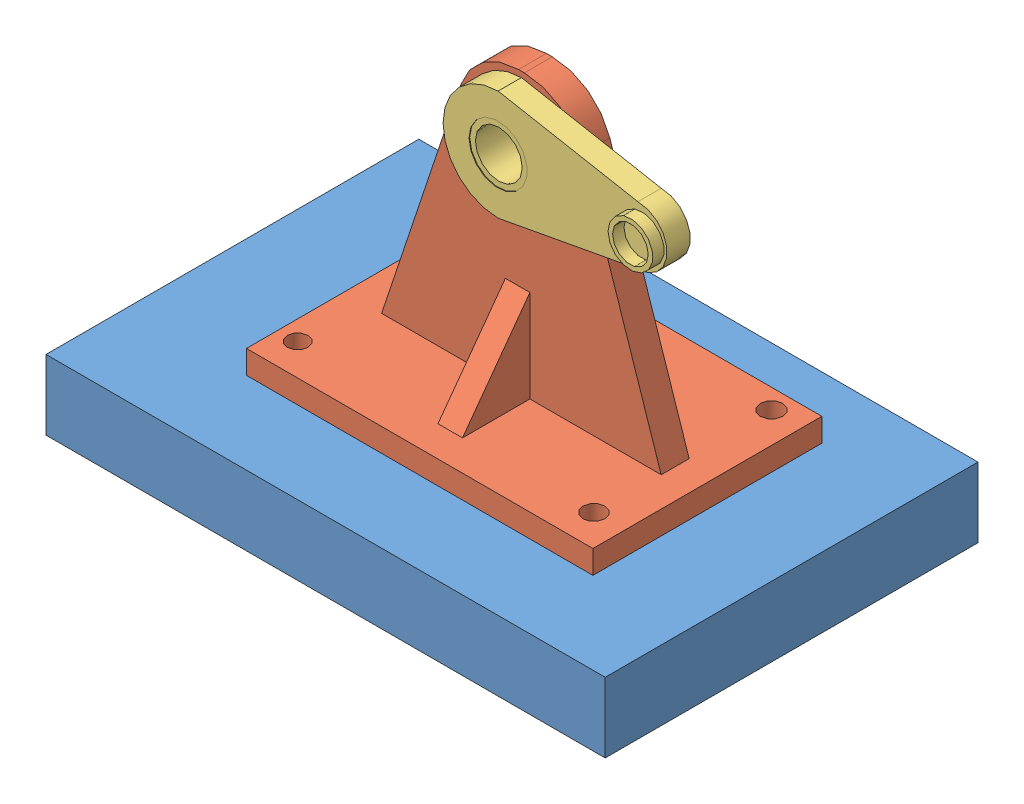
SolidWorks assembly Bill of Materials.SLDASM, configuration Default (file format 4700). Lengths in mm.
Overall size (152.4 101.6 101.6).
4 component instances, 3 part files, 2 mates.
Components (placement in the parent):
- Subassembly-1: Subassembly.SLDASM [Default] at (-0.0724 0.0701 -0.0094) size (152.4 101.6 101.6)
  - bills_baseplate-1: bills_baseplate.SLDPRT [Default] at (-60.2529 -26.3738 49.7126) size (152.4 19.05 101.6)
  - bills_hanger-1: bills_hanger.SLDPRT [Default] at (-17.8701 -0.9738 -6.9866) size (94.43 82.55 62.39)
- bills_hinge-1: bills_hinge.SLDPRT [Default] at (20.1575 58.7863 0.624) size (61.03 30 19.62)
Mates (geometry in assembly coordinates):
- Concentric1: concentric anti-aligned: cylinder of Subassembly-1/bills_hanger-1 through (20.1575 58.7863 0.624) axis (0 0 -1) radius 7.9367; cylinder of bills_hinge-1 through (20.1575 58.7863 -9.536) axis (0 0 1) radius 7.935
- Coincident1: coincident anti-aligned: plane of Subassembly-1/bills_hanger-1 through (20.9577 58.7863 0.624) normal (0 0 1); plane of bills_hinge-1 through (35.3462 5.5463 0.624) normal (0 0 -1)
